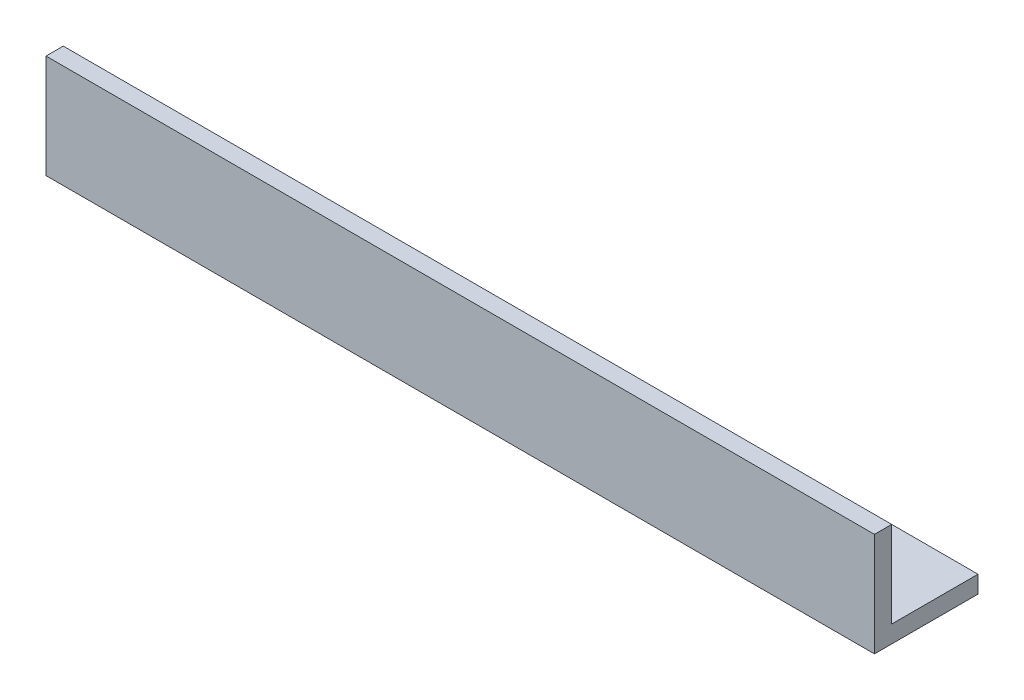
from build123d import *

# Parameters (mm, degrees)
BOSS_EXTRUDE1_DEPTH = 304.8


with BuildPart() as part:
    # Sketch1 → Boss-Extrude1 (new body)
    with BuildSketch(Plane(origin=(0, 0, 0), x_dir=(0, 0, -1), z_dir=(1, 0, 0))):
        Polygon((0, 0), (0, 38.1), (6.35, 38.1), (6.35, 6.35), (38.1, 6.35), (38.1, 0), align=None)
    extrude(amount=BOSS_EXTRUDE1_DEPTH)


solid = part.part
